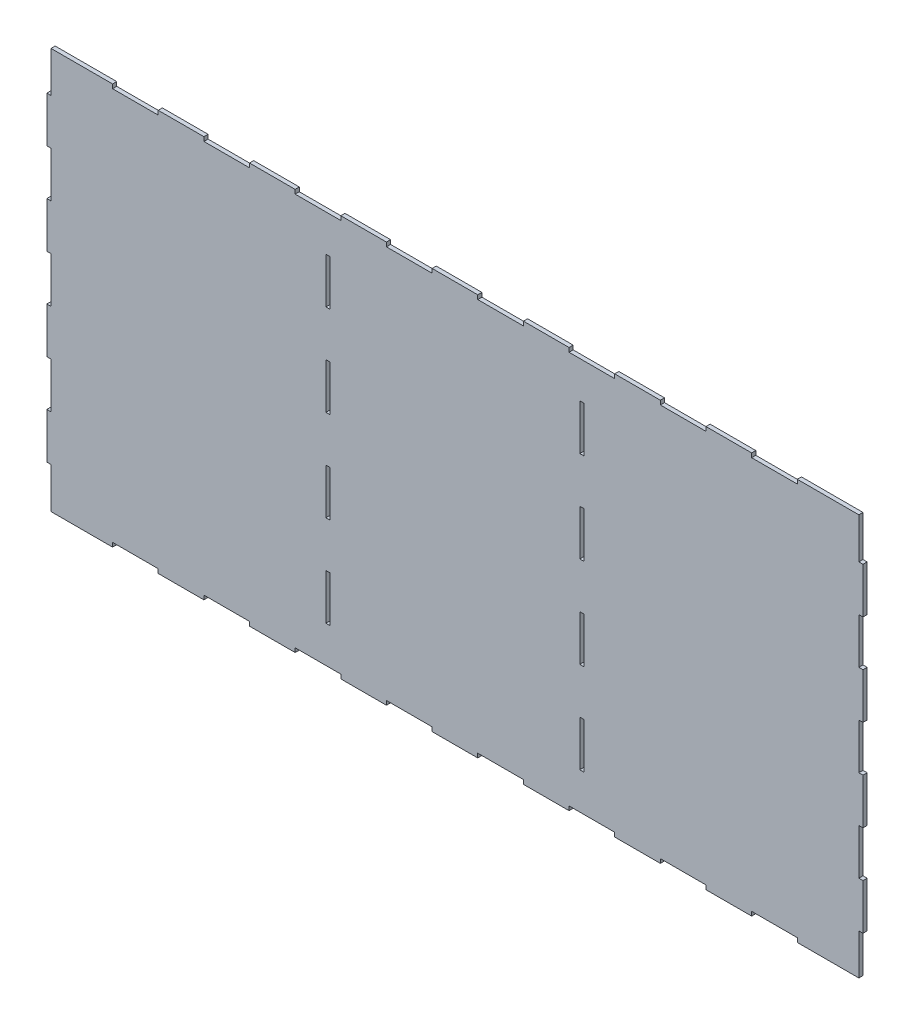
from build123d import *

# Parameters (mm, degrees)
SKETCH1_W           = 3
SKETCH1_H           = 33
BOSS_EXTRUDE1_DEPTH = 3


with BuildPart() as part:
    # Sketch1 → Boss-Extrude1 (new body)
    with BuildSketch(Plane.XY):
        Polygon((296, 586), (296, 556.5), (293, 556.5), (293, 523.5), (296, 523.5), (296, 490.5), (293, 490.5), (293, 457.5), (296, 457.5), (296, 424.5), (293, 424.5), (293, 391.5), (296, 391.5), (296, 358.5), (293, 358.5), (293, 325.5), (296, 325.5), (296, 296), (340.5, 296), (340.5, 299), (373.5, 299), (373.5, 296), (406.5, 296), (406.5, 299), (439.5, 299), (439.5, 296), (472.5, 296), (472.5, 299), (505.5, 299), (505.5, 296), (538.5, 296), (538.5, 299), (571.5, 299), (571.5, 296), (604.5, 296), (604.5, 299), (637.5, 299), (637.5, 296), (670.5, 296), (670.5, 299), (703.5, 299), (703.5, 296), (736.5, 296), (736.5, 299), (769.5, 299), (769.5, 296), (802.5, 296), (802.5, 299), (835.5, 299), (835.5, 296), (868.5, 296), (880, 296), (880, 325.5), (883, 325.5), (883, 358.5), (880, 358.5), (880, 391.5), (883, 391.5), (883, 424.5), (880, 424.5), (880, 457.5), (883, 457.5), (883, 490.5), (880, 490.5), (880, 523.5), (883, 523.5), (883, 556.5), (880, 556.5), (880, 586), (835.5, 586), (835.5, 583), (802.5, 583), (802.5, 586), (769.5, 586), (769.5, 583), (736.5, 583), (736.5, 586), (703.5, 586), (703.5, 583), (670.5, 583), (670.5, 586), (637.5, 586), (637.5, 583), (604.5, 583), (604.5, 586), (571.5, 586), (571.5, 583), (538.5, 583), (538.5, 586), (505.5, 586), (505.5, 583), (472.5, 583), (472.5, 586), (439.5, 586), (439.5, 583), (406.5, 583), (406.5, 586), (373.5, 586), (373.5, 583), (340.5, 583), (340.5, 586), (307.5, 586), align=None)
        with Locations((496.25, 540)):
            Rectangle(SKETCH1_W, SKETCH1_H, mode=Mode.SUBTRACT)
        with Locations((679.75, 540)):
            Rectangle(SKETCH1_W, SKETCH1_H, mode=Mode.SUBTRACT)
        with Locations((679.75, 474)):
            Rectangle(SKETCH1_W, SKETCH1_H, mode=Mode.SUBTRACT)
        with Locations((679.75, 408)):
            Rectangle(SKETCH1_W, SKETCH1_H, mode=Mode.SUBTRACT)
        with Locations((679.75, 342)):
            Rectangle(SKETCH1_W, SKETCH1_H, mode=Mode.SUBTRACT)
        with Locations((496.25, 474)):
            Rectangle(SKETCH1_W, SKETCH1_H, mode=Mode.SUBTRACT)
        with Locations((496.25, 408)):
            Rectangle(SKETCH1_W, SKETCH1_H, mode=Mode.SUBTRACT)
        with Locations((496.25, 342)):
            Rectangle(SKETCH1_W, SKETCH1_H, mode=Mode.SUBTRACT)
    extrude(amount=BOSS_EXTRUDE1_DEPTH)


solid = part.part
